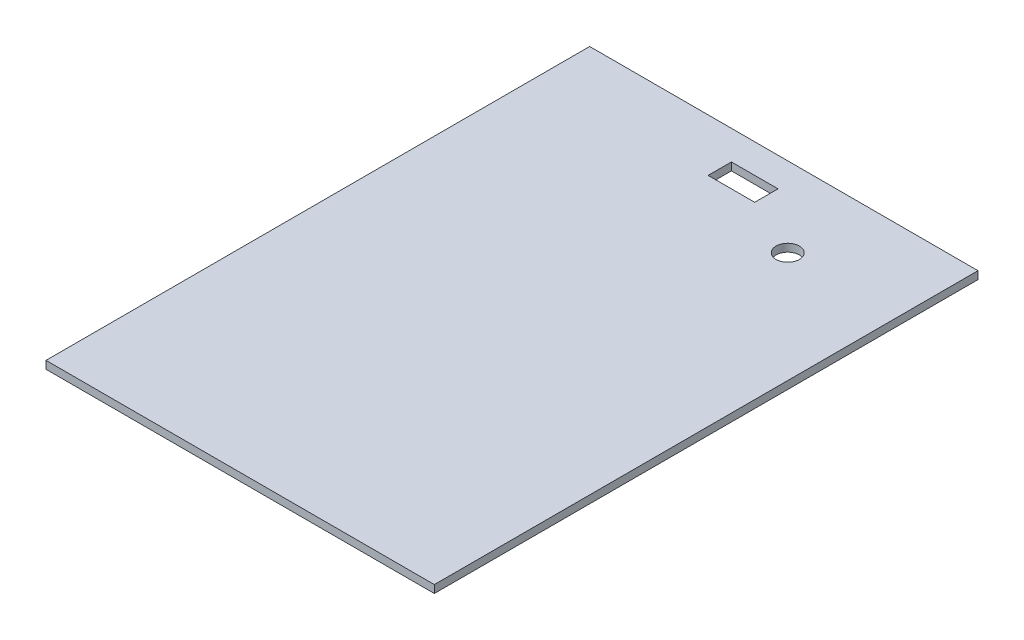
from build123d import *

# Parameters (mm, degrees)
ESQUISSE1_W      = 100
ESQUISSE1_H      = 140
ESQUISSE1_R      = 3
ESQUISSE1_W_2    = 12
ESQUISSE1_H_2    = 6
EXTRUSION1_DEPTH = 2


with BuildPart() as part:
    # Esquisse1 → Extrusion1 (new body)
    with BuildSketch(Plane(origin=(0, 0, 0), x_dir=(1, 0, 0), z_dir=(0, 1, 0))):
        with Locations((47.5, 67.5)):
            Rectangle(ESQUISSE1_W, ESQUISSE1_H)
        with Locations(Location((69, 117, 0), (0, 0, 270))):
            Circle(ESQUISSE1_R, mode=Mode.SUBTRACT)
        with Locations((47.5, 127)):
            Rectangle(ESQUISSE1_W_2, ESQUISSE1_H_2, mode=Mode.SUBTRACT)
    extrude(amount=EXTRUSION1_DEPTH)


solid = part.part
